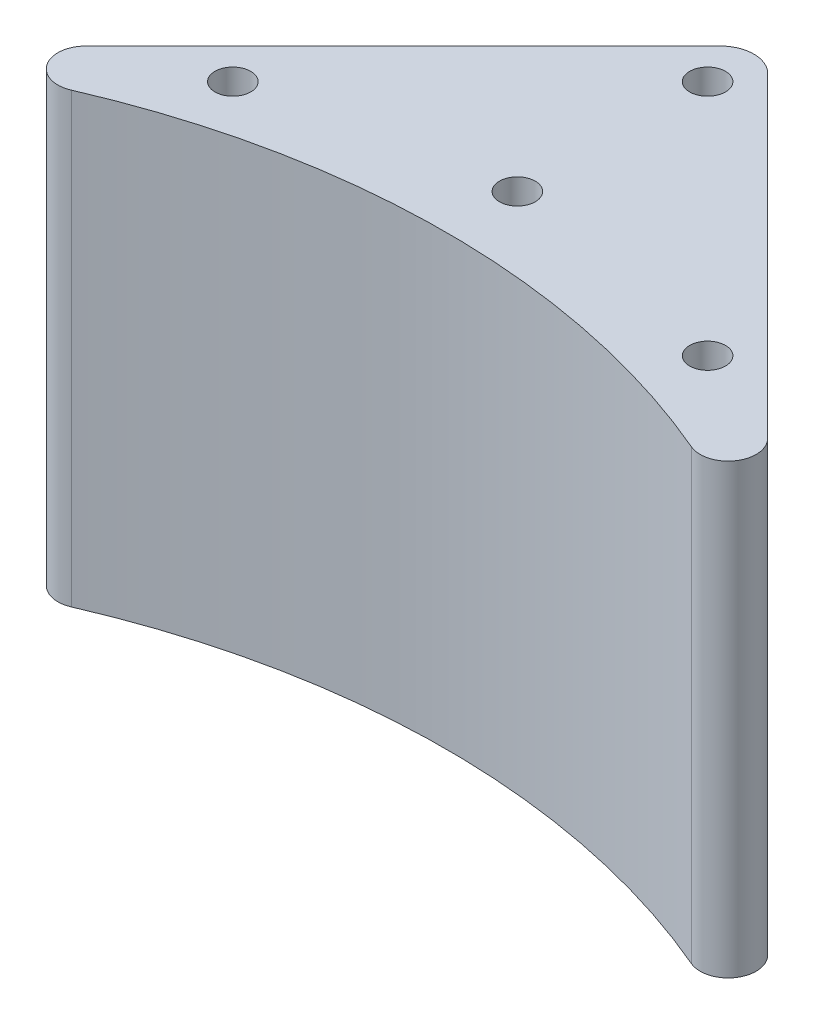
ISO-10303-21;
HEADER;
FILE_DESCRIPTION(('STEP AP214'),'2;1');
FILE_NAME('part.step','',(''),(''),'','','');
FILE_SCHEMA(('AUTOMOTIVE_DESIGN { 1 0 10303 214 1 1 1 1 }'));
ENDSEC;
DATA;
#1=APPLICATION_CONTEXT('core data for automotive mechanical design processes');
#2=APPLICATION_PROTOCOL_DEFINITION('international standard','automotive_design',2000,#1);
#3=PRODUCT_CONTEXT('',#1,'mechanical');
#4=PRODUCT('Part','Part','',(#3));
#5=PRODUCT_RELATED_PRODUCT_CATEGORY('part','',(#4));
#6=PRODUCT_DEFINITION_FORMATION('','',#4);
#7=PRODUCT_DEFINITION_CONTEXT('part definition',#1,'design');
#8=PRODUCT_DEFINITION('design','',#6,#7);
#9=PRODUCT_DEFINITION_SHAPE('','',#8);
#10=(LENGTH_UNIT() NAMED_UNIT(*) SI_UNIT(.MILLI.,.METRE.));
#11=(NAMED_UNIT(*) PLANE_ANGLE_UNIT() SI_UNIT($,.RADIAN.));
#12=(NAMED_UNIT(*) SI_UNIT($,.STERADIAN.) SOLID_ANGLE_UNIT());
#13=UNCERTAINTY_MEASURE_WITH_UNIT(LENGTH_MEASURE(1.E-05),#10,'distance_accuracy_value','');
#14=(GEOMETRIC_REPRESENTATION_CONTEXT(3) GLOBAL_UNCERTAINTY_ASSIGNED_CONTEXT((#13)) GLOBAL_UNIT_ASSIGNED_CONTEXT((#10,
#11,#12)) REPRESENTATION_CONTEXT('',''));
#15=CARTESIAN_POINT('',(0.,0.,0.));
#16=DIRECTION('',(0.,0.,1.));
#17=DIRECTION('',(1.,0.,0.));
#18=AXIS2_PLACEMENT_3D('',#15,#16,#17);
#19=CARTESIAN_POINT('',(28.5231349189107,40.,39.4125793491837));
#20=DIRECTION('',(0.,1.,0.));
#21=DIRECTION('',(0.,0.,1.));
#22=AXIS2_PLACEMENT_3D('',#19,#20,#21);
#23=PLANE('',#22);
#24=CARTESIAN_POINT('',(0.,40.,29.7279220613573));
#25=DIRECTION('',(0.,1.,0.));
#26=DIRECTION('',(0.,0.,1.));
#27=AXIS2_PLACEMENT_3D('',#24,#25,#26);
#28=CIRCLE('',#27,1.6);
#29=CARTESIAN_POINT('',(0.,40.,31.3279220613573));
#30=VERTEX_POINT('',#29);
#31=EDGE_CURVE('E148',#30,#30,#28,.T.);
#32=ORIENTED_EDGE('',*,*,#31,.F.);
#33=EDGE_LOOP('',(#32));
#34=FACE_BOUND('',#33,.T.);
#35=CARTESIAN_POINT('',(21.2132034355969,40.,33.9411254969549));
#36=DIRECTION('',(0.,1.,0.));
#37=DIRECTION('',(0.,0.,1.));
#38=AXIS2_PLACEMENT_3D('',#35,#36,#37);
#39=CIRCLE('',#38,1.6);
#40=CARTESIAN_POINT('',(21.2132034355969,40.,35.5411254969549));
#41=VERTEX_POINT('',#40);
#42=EDGE_CURVE('E134',#41,#41,#39,.T.);
#43=ORIENTED_EDGE('',*,*,#42,.F.);
#44=EDGE_LOOP('',(#43));
#45=FACE_BOUND('',#44,.T.);
#46=DIRECTION('',(-0.707106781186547,0.,-0.707106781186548));
#47=VECTOR('',#46,1.);
#48=CARTESIAN_POINT('',(-0.0707106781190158,40.,7.28319984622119));
#49=LINE('',#48,#47);
#50=CARTESIAN_POINT('',(30.2909018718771,40.,37.6448123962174));
#51=VERTEX_POINT('',#50);
#52=CARTESIAN_POINT('',(2.05060966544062,40.,9.40452018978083));
#53=VERTEX_POINT('',#52);
#54=EDGE_CURVE('E89',#51,#53,#49,.T.);
#55=ORIENTED_EDGE('',*,*,#54,.T.);
#56=CARTESIAN_POINT('',(-0.0707106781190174,40.,11.5258405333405));
#57=DIRECTION('',(0.,1.,0.));
#58=DIRECTION('',(0.,0.,1.));
#59=AXIS2_PLACEMENT_3D('',#56,#57,#58);
#60=CIRCLE('',#59,3.);
#61=CARTESIAN_POINT('',(-2.19203102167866,40.,9.40452018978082));
#62=VERTEX_POINT('',#61);
#63=EDGE_CURVE('E11',#53,#62,#60,.T.);
#64=ORIENTED_EDGE('',*,*,#63,.T.);
#65=DIRECTION('',(-0.707106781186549,0.,0.707106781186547));
#66=VECTOR('',#65,1.);
#67=CARTESIAN_POINT('',(-30.5390695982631,40.,37.7515587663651));
#68=LINE('',#67,#66);
#69=CARTESIAN_POINT('',(-30.5390695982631,40.,37.7515587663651));
#70=VERTEX_POINT('',#69);
#71=EDGE_CURVE('E97',#62,#70,#68,.T.);
#72=ORIENTED_EDGE('',*,*,#71,.T.);
#73=CARTESIAN_POINT('',(-28.7713026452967,40.,39.5193257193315));
#74=DIRECTION('',(0.,1.,0.));
#75=DIRECTION('',(0.,0.,-1.));
#76=AXIS2_PLACEMENT_3D('',#73,#74,#75);
#77=CIRCLE('',#76,2.50000000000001);
#78=CARTESIAN_POINT('',(-27.7791887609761,40.,41.8140392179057));
#79=VERTEX_POINT('',#78);
#80=EDGE_CURVE('E136',#70,#79,#77,.T.);
#81=ORIENTED_EDGE('',*,*,#80,.T.);
#82=CARTESIAN_POINT('',(0.,40.,106.066017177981));
#83=DIRECTION('',(0.,-1.,0.));
#84=DIRECTION('',(0.,0.,-1.));
#85=AXIS2_PLACEMENT_3D('',#82,#83,#84);
#86=CIRCLE('',#85,69.999999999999);
#87=CARTESIAN_POINT('',(27.5395785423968,40.,41.7109737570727));
#88=VERTEX_POINT('',#87);
#89=EDGE_CURVE('E103',#79,#88,#86,.T.);
#90=ORIENTED_EDGE('',*,*,#89,.T.);
#91=CARTESIAN_POINT('',(28.5231349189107,40.,39.4125793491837));
#92=DIRECTION('',(0.,1.,0.));
#93=DIRECTION('',(0.,0.,1.));
#94=AXIS2_PLACEMENT_3D('',#91,#92,#93);
#95=CIRCLE('',#94,2.50000000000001);
#96=EDGE_CURVE('E98',#88,#51,#95,.T.);
#97=ORIENTED_EDGE('',*,*,#96,.T.);
#98=EDGE_LOOP('',(#55,#64,#72,#81,#90,#97));
#99=FACE_BOUND('',#98,.T.);
#100=CARTESIAN_POINT('',(0.,40.,12.7279220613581));
#101=DIRECTION('',(0.,1.,0.));
#102=DIRECTION('',(0.,0.,1.));
#103=AXIS2_PLACEMENT_3D('',#100,#101,#102);
#104=CIRCLE('',#103,1.6);
#105=CARTESIAN_POINT('',(0.,40.,14.3279220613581));
#106=VERTEX_POINT('',#105);
#107=EDGE_CURVE('E142',#106,#106,#104,.T.);
#108=ORIENTED_EDGE('',*,*,#107,.F.);
#109=EDGE_LOOP('',(#108));
#110=FACE_BOUND('',#109,.T.);
#111=CARTESIAN_POINT('',(-21.2132034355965,40.,33.9411254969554));
#112=DIRECTION('',(0.,1.,0.));
#113=DIRECTION('',(0.,0.,1.));
#114=AXIS2_PLACEMENT_3D('',#111,#112,#113);
#115=CIRCLE('',#114,1.6);
#116=CARTESIAN_POINT('',(-21.2132034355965,40.,35.5411254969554));
#117=VERTEX_POINT('',#116);
#118=EDGE_CURVE('E154',#117,#117,#115,.T.);
#119=ORIENTED_EDGE('',*,*,#118,.F.);
#120=EDGE_LOOP('',(#119));
#121=FACE_BOUND('',#120,.T.);
#122=ADVANCED_FACE('F40',(#34,#45,#99,#110,#121),#23,.T.);
#123=CARTESIAN_POINT('',(28.5231349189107,0.,39.4125793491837));
#124=DIRECTION('',(0.,1.,0.));
#125=DIRECTION('',(0.,0.,1.));
#126=AXIS2_PLACEMENT_3D('',#123,#124,#125);
#127=PLANE('',#126);
#128=DIRECTION('',(-0.707106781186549,0.,0.707106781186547));
#129=VECTOR('',#128,1.);
#130=CARTESIAN_POINT('',(-30.5390695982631,0.,37.7515587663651));
#131=LINE('',#130,#129);
#132=CARTESIAN_POINT('',(-2.19203102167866,0.,9.40452018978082));
#133=VERTEX_POINT('',#132);
#134=CARTESIAN_POINT('',(-30.5390695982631,0.,37.7515587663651));
#135=VERTEX_POINT('',#134);
#136=EDGE_CURVE('E129',#133,#135,#131,.T.);
#137=ORIENTED_EDGE('',*,*,#136,.F.);
#138=CARTESIAN_POINT('',(-0.0707106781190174,0.,11.5258405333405));
#139=DIRECTION('',(0.,1.,0.));
#140=DIRECTION('',(0.,0.,1.));
#141=AXIS2_PLACEMENT_3D('',#138,#139,#140);
#142=CIRCLE('',#141,3.);
#143=CARTESIAN_POINT('',(2.05060966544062,0.,9.40452018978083));
#144=VERTEX_POINT('',#143);
#145=EDGE_CURVE('E62',#133,#144,#142,.F.);
#146=ORIENTED_EDGE('',*,*,#145,.T.);
#147=DIRECTION('',(-0.707106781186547,0.,-0.707106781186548));
#148=VECTOR('',#147,1.);
#149=CARTESIAN_POINT('',(-0.0707106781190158,0.,7.28319984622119));
#150=LINE('',#149,#148);
#151=CARTESIAN_POINT('',(30.2909018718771,0.,37.6448123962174));
#152=VERTEX_POINT('',#151);
#153=EDGE_CURVE('E131',#152,#144,#150,.T.);
#154=ORIENTED_EDGE('',*,*,#153,.F.);
#155=CARTESIAN_POINT('',(28.5231349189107,0.,39.4125793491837));
#156=DIRECTION('',(0.,1.,0.));
#157=DIRECTION('',(0.,0.,1.));
#158=AXIS2_PLACEMENT_3D('',#155,#156,#157);
#159=CIRCLE('',#158,2.50000000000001);
#160=CARTESIAN_POINT('',(27.5395785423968,0.,41.7109737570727));
#161=VERTEX_POINT('',#160);
#162=EDGE_CURVE('E111',#161,#152,#159,.T.);
#163=ORIENTED_EDGE('',*,*,#162,.F.);
#164=CARTESIAN_POINT('',(0.,0.,106.066017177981));
#165=DIRECTION('',(0.,-1.,0.));
#166=DIRECTION('',(0.,0.,-1.));
#167=AXIS2_PLACEMENT_3D('',#164,#165,#166);
#168=CIRCLE('',#167,69.999999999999);
#169=CARTESIAN_POINT('',(-27.7791887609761,0.,41.8140392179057));
#170=VERTEX_POINT('',#169);
#171=EDGE_CURVE('E107',#170,#161,#168,.T.);
#172=ORIENTED_EDGE('',*,*,#171,.F.);
#173=CARTESIAN_POINT('',(-28.7713026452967,0.,39.5193257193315));
#174=DIRECTION('',(0.,1.,0.));
#175=DIRECTION('',(0.,0.,-1.));
#176=AXIS2_PLACEMENT_3D('',#173,#174,#175);
#177=CIRCLE('',#176,2.50000000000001);
#178=EDGE_CURVE('E127',#135,#170,#177,.T.);
#179=ORIENTED_EDGE('',*,*,#178,.F.);
#180=EDGE_LOOP('',(#137,#146,#154,#163,#172,#179));
#181=FACE_BOUND('',#180,.T.);
#182=CARTESIAN_POINT('',(21.2132034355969,0.,33.9411254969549));
#183=DIRECTION('',(0.,1.,0.));
#184=DIRECTION('',(0.,0.,1.));
#185=AXIS2_PLACEMENT_3D('',#182,#183,#184);
#186=CIRCLE('',#185,1.6);
#187=CARTESIAN_POINT('',(21.2132034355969,0.,35.5411254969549));
#188=VERTEX_POINT('',#187);
#189=EDGE_CURVE('E139',#188,#188,#186,.T.);
#190=ORIENTED_EDGE('',*,*,#189,.T.);
#191=EDGE_LOOP('',(#190));
#192=FACE_BOUND('',#191,.T.);
#193=CARTESIAN_POINT('',(0.,0.,12.7279220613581));
#194=DIRECTION('',(0.,1.,0.));
#195=DIRECTION('',(0.,0.,1.));
#196=AXIS2_PLACEMENT_3D('',#193,#194,#195);
#197=CIRCLE('',#196,1.6);
#198=CARTESIAN_POINT('',(0.,0.,14.3279220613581));
#199=VERTEX_POINT('',#198);
#200=EDGE_CURVE('E145',#199,#199,#197,.T.);
#201=ORIENTED_EDGE('',*,*,#200,.T.);
#202=EDGE_LOOP('',(#201));
#203=FACE_BOUND('',#202,.T.);
#204=CARTESIAN_POINT('',(0.,0.,29.7279220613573));
#205=DIRECTION('',(0.,1.,0.));
#206=DIRECTION('',(0.,0.,1.));
#207=AXIS2_PLACEMENT_3D('',#204,#205,#206);
#208=CIRCLE('',#207,1.6);
#209=CARTESIAN_POINT('',(0.,0.,31.3279220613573));
#210=VERTEX_POINT('',#209);
#211=EDGE_CURVE('E151',#210,#210,#208,.T.);
#212=ORIENTED_EDGE('',*,*,#211,.T.);
#213=EDGE_LOOP('',(#212));
#214=FACE_BOUND('',#213,.T.);
#215=CARTESIAN_POINT('',(-21.2132034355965,0.,33.9411254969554));
#216=DIRECTION('',(0.,1.,0.));
#217=DIRECTION('',(0.,0.,1.));
#218=AXIS2_PLACEMENT_3D('',#215,#216,#217);
#219=CIRCLE('',#218,1.6);
#220=CARTESIAN_POINT('',(-21.2132034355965,0.,35.5411254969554));
#221=VERTEX_POINT('',#220);
#222=EDGE_CURVE('E157',#221,#221,#219,.T.);
#223=ORIENTED_EDGE('',*,*,#222,.T.);
#224=EDGE_LOOP('',(#223));
#225=FACE_BOUND('',#224,.T.);
#226=ADVANCED_FACE('F167',(#181,#192,#203,#214,#225),#127,.F.);
#227=CARTESIAN_POINT('',(28.5231349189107,40.,39.4125793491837));
#228=DIRECTION('',(0.,-1.,0.));
#229=DIRECTION('',(0.,0.,-1.));
#230=AXIS2_PLACEMENT_3D('',#227,#228,#229);
#231=CYLINDRICAL_SURFACE('',#230,2.50000000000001);
#232=ORIENTED_EDGE('',*,*,#162,.T.);
#233=DIRECTION('',(0.,-1.,0.));
#234=VECTOR('',#233,1.);
#235=CARTESIAN_POINT('',(30.2909018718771,40.,37.6448123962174));
#236=LINE('',#235,#234);
#237=EDGE_CURVE('E93',#51,#152,#236,.T.);
#238=ORIENTED_EDGE('',*,*,#237,.F.);
#239=ORIENTED_EDGE('',*,*,#96,.F.);
#240=DIRECTION('',(0.,-1.,0.));
#241=VECTOR('',#240,1.);
#242=CARTESIAN_POINT('',(27.5395785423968,40.,41.7109737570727));
#243=LINE('',#242,#241);
#244=EDGE_CURVE('E124',#88,#161,#243,.T.);
#245=ORIENTED_EDGE('',*,*,#244,.T.);
#246=EDGE_LOOP('',(#232,#238,#239,#245));
#247=FACE_BOUND('',#246,.T.);
#248=ADVANCED_FACE('F109',(#247),#231,.T.);
#249=CARTESIAN_POINT('',(-0.0707106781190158,40.,7.28319984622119));
#250=DIRECTION('',(-0.707106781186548,0.,0.707106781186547));
#251=DIRECTION('',(0.707106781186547,0.,0.707106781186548));
#252=AXIS2_PLACEMENT_3D('',#249,#250,#251);
#253=PLANE('',#252);
#254=ORIENTED_EDGE('',*,*,#153,.T.);
#255=DIRECTION('',(0.,-1.,0.));
#256=VECTOR('',#255,1.);
#257=CARTESIAN_POINT('',(2.05060966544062,40.,9.40452018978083));
#258=LINE('',#257,#256);
#259=EDGE_CURVE('E48',#144,#53,#258,.F.);
#260=ORIENTED_EDGE('',*,*,#259,.T.);
#261=ORIENTED_EDGE('',*,*,#54,.F.);
#262=ORIENTED_EDGE('',*,*,#237,.T.);
#263=EDGE_LOOP('',(#254,#260,#261,#262));
#264=FACE_BOUND('',#263,.T.);
#265=ADVANCED_FACE('F91',(#264),#253,.F.);
#266=CARTESIAN_POINT('',(-30.5390695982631,40.,37.7515587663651));
#267=DIRECTION('',(0.707106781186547,0.,0.707106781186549));
#268=DIRECTION('',(0.707106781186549,0.,-0.707106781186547));
#269=AXIS2_PLACEMENT_3D('',#266,#267,#268);
#270=PLANE('',#269);
#271=ORIENTED_EDGE('',*,*,#71,.F.);
#272=DIRECTION('',(0.,-1.,0.));
#273=VECTOR('',#272,1.);
#274=CARTESIAN_POINT('',(-2.19203102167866,40.,9.40452018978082));
#275=LINE('',#274,#273);
#276=EDGE_CURVE('E112',#62,#133,#275,.T.);
#277=ORIENTED_EDGE('',*,*,#276,.T.);
#278=ORIENTED_EDGE('',*,*,#136,.T.);
#279=DIRECTION('',(0.,-1.,0.));
#280=VECTOR('',#279,1.);
#281=CARTESIAN_POINT('',(-30.5390695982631,40.,37.7515587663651));
#282=LINE('',#281,#280);
#283=EDGE_CURVE('E113',#70,#135,#282,.T.);
#284=ORIENTED_EDGE('',*,*,#283,.F.);
#285=EDGE_LOOP('',(#271,#277,#278,#284));
#286=FACE_BOUND('',#285,.T.);
#287=ADVANCED_FACE('F188',(#286),#270,.F.);
#288=CARTESIAN_POINT('',(-28.7713026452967,40.,39.5193257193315));
#289=DIRECTION('',(0.,-1.,0.));
#290=DIRECTION('',(0.,0.,-1.));
#291=AXIS2_PLACEMENT_3D('',#288,#289,#290);
#292=CYLINDRICAL_SURFACE('',#291,2.50000000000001);
#293=ORIENTED_EDGE('',*,*,#178,.T.);
#294=DIRECTION('',(0.,-1.,0.));
#295=VECTOR('',#294,1.);
#296=CARTESIAN_POINT('',(-27.7791887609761,40.,41.8140392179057));
#297=LINE('',#296,#295);
#298=EDGE_CURVE('E118',#79,#170,#297,.T.);
#299=ORIENTED_EDGE('',*,*,#298,.F.);
#300=ORIENTED_EDGE('',*,*,#80,.F.);
#301=ORIENTED_EDGE('',*,*,#283,.T.);
#302=EDGE_LOOP('',(#293,#299,#300,#301));
#303=FACE_BOUND('',#302,.T.);
#304=ADVANCED_FACE('F184',(#303),#292,.T.);
#305=CARTESIAN_POINT('',(0.,40.,106.066017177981));
#306=DIRECTION('',(0.,-1.,0.));
#307=DIRECTION('',(0.,0.,-1.));
#308=AXIS2_PLACEMENT_3D('',#305,#306,#307);
#309=CYLINDRICAL_SURFACE('',#308,69.999999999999);
#310=ORIENTED_EDGE('',*,*,#171,.T.);
#311=ORIENTED_EDGE('',*,*,#244,.F.);
#312=ORIENTED_EDGE('',*,*,#89,.F.);
#313=ORIENTED_EDGE('',*,*,#298,.T.);
#314=EDGE_LOOP('',(#310,#311,#312,#313));
#315=FACE_BOUND('',#314,.T.);
#316=ADVANCED_FACE('F181',(#315),#309,.F.);
#317=CARTESIAN_POINT('',(21.2132034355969,40.,33.9411254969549));
#318=DIRECTION('',(0.,-1.,0.));
#319=DIRECTION('',(0.,0.,-1.));
#320=AXIS2_PLACEMENT_3D('',#317,#318,#319);
#321=CYLINDRICAL_SURFACE('',#320,1.6);
#322=ORIENTED_EDGE('',*,*,#42,.T.);
#323=EDGE_LOOP('',(#322));
#324=FACE_BOUND('',#323,.T.);
#325=ORIENTED_EDGE('',*,*,#189,.F.);
#326=EDGE_LOOP('',(#325));
#327=FACE_BOUND('',#326,.T.);
#328=ADVANCED_FACE('F178',(#324,#327),#321,.F.);
#329=CARTESIAN_POINT('',(0.,40.,12.7279220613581));
#330=DIRECTION('',(0.,-1.,0.));
#331=DIRECTION('',(0.,0.,-1.));
#332=AXIS2_PLACEMENT_3D('',#329,#330,#331);
#333=CYLINDRICAL_SURFACE('',#332,1.6);
#334=ORIENTED_EDGE('',*,*,#107,.T.);
#335=EDGE_LOOP('',(#334));
#336=FACE_BOUND('',#335,.T.);
#337=ORIENTED_EDGE('',*,*,#200,.F.);
#338=EDGE_LOOP('',(#337));
#339=FACE_BOUND('',#338,.T.);
#340=ADVANCED_FACE('F217',(#336,#339),#333,.F.);
#341=CARTESIAN_POINT('',(0.,40.,29.7279220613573));
#342=DIRECTION('',(0.,-1.,0.));
#343=DIRECTION('',(0.,0.,-1.));
#344=AXIS2_PLACEMENT_3D('',#341,#342,#343);
#345=CYLINDRICAL_SURFACE('',#344,1.6);
#346=ORIENTED_EDGE('',*,*,#31,.T.);
#347=EDGE_LOOP('',(#346));
#348=FACE_BOUND('',#347,.T.);
#349=ORIENTED_EDGE('',*,*,#211,.F.);
#350=EDGE_LOOP('',(#349));
#351=FACE_BOUND('',#350,.T.);
#352=ADVANCED_FACE('F225',(#348,#351),#345,.F.);
#353=CARTESIAN_POINT('',(-21.2132034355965,40.,33.9411254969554));
#354=DIRECTION('',(0.,-1.,0.));
#355=DIRECTION('',(0.,0.,-1.));
#356=AXIS2_PLACEMENT_3D('',#353,#354,#355);
#357=CYLINDRICAL_SURFACE('',#356,1.6);
#358=ORIENTED_EDGE('',*,*,#118,.T.);
#359=EDGE_LOOP('',(#358));
#360=FACE_BOUND('',#359,.T.);
#361=ORIENTED_EDGE('',*,*,#222,.F.);
#362=EDGE_LOOP('',(#361));
#363=FACE_BOUND('',#362,.T.);
#364=ADVANCED_FACE('F163',(#360,#363),#357,.F.);
#365=CARTESIAN_POINT('',(-0.0707106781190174,40.,11.5258405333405));
#366=DIRECTION('',(0.,-1.,0.));
#367=DIRECTION('',(0.,0.,-1.));
#368=AXIS2_PLACEMENT_3D('',#365,#366,#367);
#369=CYLINDRICAL_SURFACE('',#368,3.);
#370=ORIENTED_EDGE('',*,*,#63,.F.);
#371=ORIENTED_EDGE('',*,*,#259,.F.);
#372=ORIENTED_EDGE('',*,*,#145,.F.);
#373=ORIENTED_EDGE('',*,*,#276,.F.);
#374=EDGE_LOOP('',(#370,#371,#372,#373));
#375=FACE_BOUND('',#374,.T.);
#376=ADVANCED_FACE('F42',(#375),#369,.T.);
#377=CLOSED_SHELL('',(#122,#226,#248,#265,#287,#304,#316,#328,#340,#352,#364,#376));
#378=MANIFOLD_SOLID_BREP('B2',#377);
#379=ADVANCED_BREP_SHAPE_REPRESENTATION('',(#18,#378),#14);
#380=SHAPE_DEFINITION_REPRESENTATION(#9,#379);
ENDSEC;
END-ISO-10303-21;
